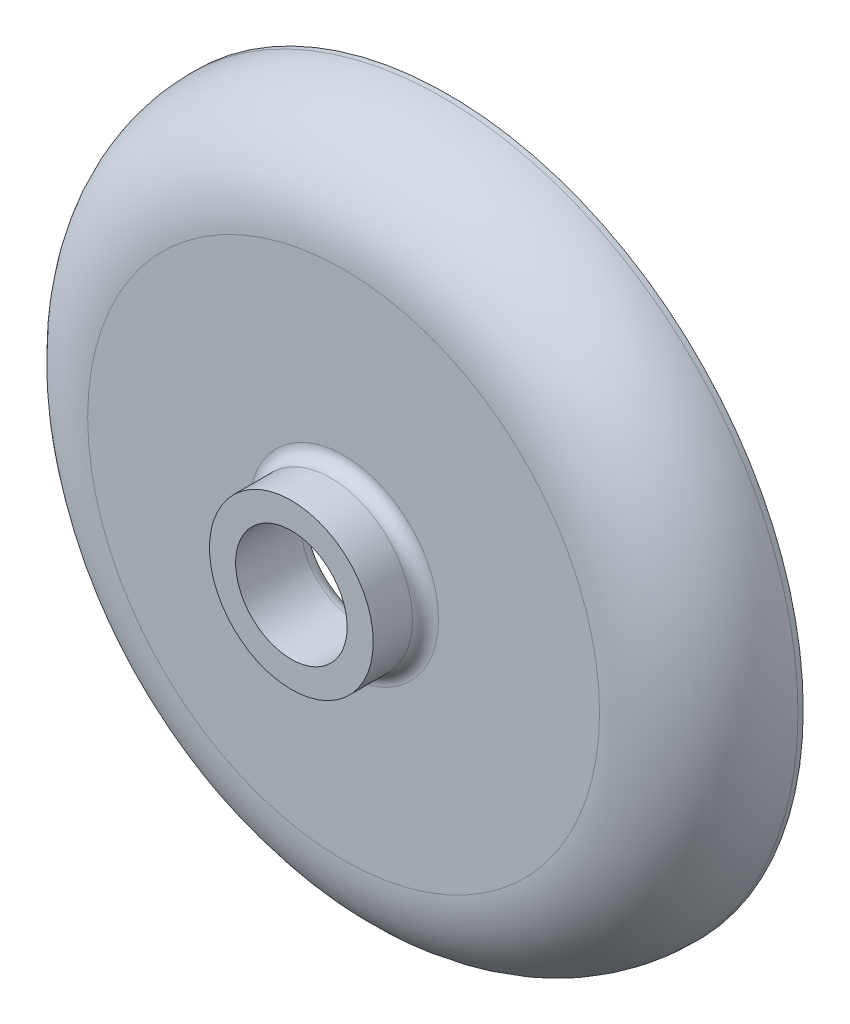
ISO-10303-21;
HEADER;
FILE_DESCRIPTION(('STEP AP214'),'2;1');
FILE_NAME('part.step','',(''),(''),'','','');
FILE_SCHEMA(('AUTOMOTIVE_DESIGN { 1 0 10303 214 1 1 1 1 }'));
ENDSEC;
DATA;
#1=APPLICATION_CONTEXT('core data for automotive mechanical design processes');
#2=APPLICATION_PROTOCOL_DEFINITION('international standard','automotive_design',2000,#1);
#3=PRODUCT_CONTEXT('',#1,'mechanical');
#4=PRODUCT('Part','Part','',(#3));
#5=PRODUCT_RELATED_PRODUCT_CATEGORY('part','',(#4));
#6=PRODUCT_DEFINITION_FORMATION('','',#4);
#7=PRODUCT_DEFINITION_CONTEXT('part definition',#1,'design');
#8=PRODUCT_DEFINITION('design','',#6,#7);
#9=PRODUCT_DEFINITION_SHAPE('','',#8);
#10=(LENGTH_UNIT() NAMED_UNIT(*) SI_UNIT(.MILLI.,.METRE.));
#11=(NAMED_UNIT(*) PLANE_ANGLE_UNIT() SI_UNIT($,.RADIAN.));
#12=(NAMED_UNIT(*) SI_UNIT($,.STERADIAN.) SOLID_ANGLE_UNIT());
#13=UNCERTAINTY_MEASURE_WITH_UNIT(LENGTH_MEASURE(1.E-05),#10,'distance_accuracy_value','');
#14=(GEOMETRIC_REPRESENTATION_CONTEXT(3) GLOBAL_UNCERTAINTY_ASSIGNED_CONTEXT((#13)) GLOBAL_UNIT_ASSIGNED_CONTEXT((#10,
#11,#12)) REPRESENTATION_CONTEXT('',''));
#15=CARTESIAN_POINT('',(0.,0.,0.));
#16=DIRECTION('',(0.,0.,1.));
#17=DIRECTION('',(1.,0.,0.));
#18=AXIS2_PLACEMENT_3D('',#15,#16,#17);
#19=CARTESIAN_POINT('',(0.,0.,4.));
#20=DIRECTION('',(0.,0.,-1.));
#21=DIRECTION('',(-1.,0.,0.));
#22=AXIS2_PLACEMENT_3D('',#19,#20,#21);
#23=CYLINDRICAL_SURFACE('',#22,13.6);
#24=CARTESIAN_POINT('',(0.,0.,0.2));
#25=DIRECTION('',(0.,0.,1.));
#26=DIRECTION('',(1.,0.,0.));
#27=AXIS2_PLACEMENT_3D('',#24,#25,#26);
#28=CIRCLE('',#27,13.6);
#29=CARTESIAN_POINT('',(13.6,0.,0.2));
#30=VERTEX_POINT('',#29);
#31=EDGE_CURVE('E55',#30,#30,#28,.F.);
#32=ORIENTED_EDGE('',*,*,#31,.T.);
#33=EDGE_LOOP('',(#32));
#34=FACE_BOUND('',#33,.T.);
#35=CARTESIAN_POINT('',(0.,0.,0.));
#36=DIRECTION('',(0.,0.,1.));
#37=DIRECTION('',(1.,0.,0.));
#38=AXIS2_PLACEMENT_3D('',#35,#36,#37);
#39=CIRCLE('',#38,13.6);
#40=CARTESIAN_POINT('',(13.6,0.,0.));
#41=VERTEX_POINT('',#40);
#42=EDGE_CURVE('E61',#41,#41,#39,.T.);
#43=ORIENTED_EDGE('',*,*,#42,.T.);
#44=EDGE_LOOP('',(#43));
#45=FACE_BOUND('',#44,.T.);
#46=ADVANCED_FACE('F35',(#34,#45),#23,.T.);
#47=CARTESIAN_POINT('',(0.,0.,4.));
#48=DIRECTION('',(0.,0.,1.));
#49=DIRECTION('',(1.,0.,0.));
#50=AXIS2_PLACEMENT_3D('',#47,#48,#49);
#51=PLANE('',#50);
#52=CARTESIAN_POINT('',(0.,0.,4.));
#53=DIRECTION('',(0.,0.,1.));
#54=DIRECTION('',(1.,0.,0.));
#55=AXIS2_PLACEMENT_3D('',#52,#53,#54);
#56=CIRCLE('',#55,3.635);
#57=CARTESIAN_POINT('',(3.635,0.,4.));
#58=VERTEX_POINT('',#57);
#59=EDGE_CURVE('E46',#58,#58,#56,.F.);
#60=ORIENTED_EDGE('',*,*,#59,.T.);
#61=EDGE_LOOP('',(#60));
#62=FACE_BOUND('',#61,.T.);
#63=CARTESIAN_POINT('',(0.,0.,4.));
#64=DIRECTION('',(0.,0.,1.));
#65=DIRECTION('',(1.,0.,0.));
#66=AXIS2_PLACEMENT_3D('',#63,#64,#65);
#67=CIRCLE('',#66,9.8);
#68=CARTESIAN_POINT('',(9.8,0.,4.));
#69=VERTEX_POINT('',#68);
#70=EDGE_CURVE('E58',#69,#69,#67,.T.);
#71=ORIENTED_EDGE('',*,*,#70,.T.);
#72=EDGE_LOOP('',(#71));
#73=FACE_BOUND('',#72,.T.);
#74=ADVANCED_FACE('F102',(#62,#73),#51,.T.);
#75=CARTESIAN_POINT('',(0.,0.,0.));
#76=DIRECTION('',(0.,0.,1.));
#77=DIRECTION('',(1.,0.,0.));
#78=AXIS2_PLACEMENT_3D('',#75,#76,#77);
#79=PLANE('',#78);
#80=CARTESIAN_POINT('',(0.,0.,0.));
#81=DIRECTION('',(0.,0.,1.));
#82=DIRECTION('',(1.,0.,0.));
#83=AXIS2_PLACEMENT_3D('',#80,#81,#82);
#84=CIRCLE('',#83,12.6);
#85=CARTESIAN_POINT('',(12.6,0.,0.));
#86=VERTEX_POINT('',#85);
#87=EDGE_CURVE('E68',#86,#86,#84,.T.);
#88=ORIENTED_EDGE('',*,*,#87,.T.);
#89=EDGE_LOOP('',(#88));
#90=FACE_BOUND('',#89,.T.);
#91=ORIENTED_EDGE('',*,*,#42,.F.);
#92=EDGE_LOOP('',(#91));
#93=FACE_BOUND('',#92,.T.);
#94=ADVANCED_FACE('F97',(#90,#93),#79,.F.);
#95=CARTESIAN_POINT('',(0.,0.,0.2));
#96=DIRECTION('',(0.,0.,1.));
#97=DIRECTION('',(1.,0.,0.));
#98=AXIS2_PLACEMENT_3D('',#95,#96,#97);
#99=TOROIDAL_SURFACE('',#98,9.8,3.8);
#100=ORIENTED_EDGE('',*,*,#31,.F.);
#101=EDGE_LOOP('',(#100));
#102=FACE_BOUND('',#101,.T.);
#103=ORIENTED_EDGE('',*,*,#70,.F.);
#104=EDGE_LOOP('',(#103));
#105=FACE_BOUND('',#104,.T.);
#106=ADVANCED_FACE('F91',(#102,#105),#99,.T.);
#107=CARTESIAN_POINT('',(0.,0.,6.));
#108=DIRECTION('',(0.,0.,-1.));
#109=DIRECTION('',(-1.,0.,0.));
#110=AXIS2_PLACEMENT_3D('',#107,#108,#109);
#111=CYLINDRICAL_SURFACE('',#110,3.135);
#112=CARTESIAN_POINT('',(0.,0.,4.5));
#113=DIRECTION('',(0.,0.,1.));
#114=DIRECTION('',(1.,0.,0.));
#115=AXIS2_PLACEMENT_3D('',#112,#113,#114);
#116=CIRCLE('',#115,3.135);
#117=CARTESIAN_POINT('',(3.135,0.,4.5));
#118=VERTEX_POINT('',#117);
#119=EDGE_CURVE('E50',#118,#118,#116,.T.);
#120=ORIENTED_EDGE('',*,*,#119,.T.);
#121=EDGE_LOOP('',(#120));
#122=FACE_BOUND('',#121,.T.);
#123=CARTESIAN_POINT('',(0.,0.,6.));
#124=DIRECTION('',(0.,0.,1.));
#125=DIRECTION('',(1.,0.,0.));
#126=AXIS2_PLACEMENT_3D('',#123,#124,#125);
#127=CIRCLE('',#126,3.135);
#128=CARTESIAN_POINT('',(3.135,0.,6.));
#129=VERTEX_POINT('',#128);
#130=EDGE_CURVE('E64',#129,#129,#127,.T.);
#131=ORIENTED_EDGE('',*,*,#130,.F.);
#132=EDGE_LOOP('',(#131));
#133=FACE_BOUND('',#132,.T.);
#134=ADVANCED_FACE('F86',(#122,#133),#111,.T.);
#135=CARTESIAN_POINT('',(0.,0.,6.));
#136=DIRECTION('',(0.,0.,1.));
#137=DIRECTION('',(1.,0.,0.));
#138=AXIS2_PLACEMENT_3D('',#135,#136,#137);
#139=PLANE('',#138);
#140=CARTESIAN_POINT('',(0.,0.,6.));
#141=DIRECTION('',(0.,0.,1.));
#142=DIRECTION('',(1.,0.,0.));
#143=AXIS2_PLACEMENT_3D('',#140,#141,#142);
#144=CIRCLE('',#143,2.135);
#145=CARTESIAN_POINT('',(2.135,0.,6.));
#146=VERTEX_POINT('',#145);
#147=EDGE_CURVE('E72',#146,#146,#144,.T.);
#148=ORIENTED_EDGE('',*,*,#147,.F.);
#149=EDGE_LOOP('',(#148));
#150=FACE_BOUND('',#149,.T.);
#151=ORIENTED_EDGE('',*,*,#130,.T.);
#152=EDGE_LOOP('',(#151));
#153=FACE_BOUND('',#152,.T.);
#154=ADVANCED_FACE('F82',(#150,#153),#139,.T.);
#155=CARTESIAN_POINT('',(0.,0.,4.));
#156=DIRECTION('',(0.,0.,-1.));
#157=DIRECTION('',(-1.,0.,0.));
#158=AXIS2_PLACEMENT_3D('',#155,#156,#157);
#159=CYLINDRICAL_SURFACE('',#158,12.6);
#160=CARTESIAN_POINT('',(0.,0.,0.2));
#161=DIRECTION('',(0.,0.,-1.));
#162=DIRECTION('',(-1.,0.,0.));
#163=AXIS2_PLACEMENT_3D('',#160,#161,#162);
#164=CIRCLE('',#163,12.6);
#165=CARTESIAN_POINT('',(-12.6,0.,0.2));
#166=VERTEX_POINT('',#165);
#167=EDGE_CURVE('E67',#166,#166,#164,.T.);
#168=ORIENTED_EDGE('',*,*,#167,.F.);
#169=EDGE_LOOP('',(#168));
#170=FACE_BOUND('',#169,.T.);
#171=ORIENTED_EDGE('',*,*,#87,.F.);
#172=EDGE_LOOP('',(#171));
#173=FACE_BOUND('',#172,.T.);
#174=ADVANCED_FACE('F85',(#170,#173),#159,.F.);
#175=CARTESIAN_POINT('',(0.,0.,3.));
#176=DIRECTION('',(0.,0.,1.));
#177=DIRECTION('',(1.,0.,0.));
#178=AXIS2_PLACEMENT_3D('',#175,#176,#177);
#179=PLANE('',#178);
#180=CARTESIAN_POINT('',(0.,0.,3.));
#181=DIRECTION('',(0.,0.,1.));
#182=DIRECTION('',(1.,0.,0.));
#183=AXIS2_PLACEMENT_3D('',#180,#181,#182);
#184=CIRCLE('',#183,2.635);
#185=CARTESIAN_POINT('',(2.635,0.,3.));
#186=VERTEX_POINT('',#185);
#187=EDGE_CURVE('E42',#186,#186,#184,.T.);
#188=ORIENTED_EDGE('',*,*,#187,.T.);
#189=EDGE_LOOP('',(#188));
#190=FACE_BOUND('',#189,.T.);
#191=CARTESIAN_POINT('',(0.,0.,3.));
#192=DIRECTION('',(0.,0.,1.));
#193=DIRECTION('',(1.,0.,0.));
#194=AXIS2_PLACEMENT_3D('',#191,#192,#193);
#195=CIRCLE('',#194,9.8);
#196=CARTESIAN_POINT('',(9.8,0.,3.));
#197=VERTEX_POINT('',#196);
#198=EDGE_CURVE('E71',#197,#197,#195,.T.);
#199=ORIENTED_EDGE('',*,*,#198,.F.);
#200=EDGE_LOOP('',(#199));
#201=FACE_BOUND('',#200,.T.);
#202=ADVANCED_FACE('F130',(#190,#201),#179,.F.);
#203=CARTESIAN_POINT('',(0.,0.,0.2));
#204=DIRECTION('',(0.,0.,1.));
#205=DIRECTION('',(1.,0.,0.));
#206=AXIS2_PLACEMENT_3D('',#203,#204,#205);
#207=TOROIDAL_SURFACE('',#206,9.8,2.8);
#208=ORIENTED_EDGE('',*,*,#167,.T.);
#209=EDGE_LOOP('',(#208));
#210=FACE_BOUND('',#209,.T.);
#211=ORIENTED_EDGE('',*,*,#198,.T.);
#212=EDGE_LOOP('',(#211));
#213=FACE_BOUND('',#212,.T.);
#214=ADVANCED_FACE('F119',(#210,#213),#207,.F.);
#215=CARTESIAN_POINT('',(0.,0.,6.));
#216=DIRECTION('',(0.,0.,-1.));
#217=DIRECTION('',(-1.,0.,0.));
#218=AXIS2_PLACEMENT_3D('',#215,#216,#217);
#219=CYLINDRICAL_SURFACE('',#218,2.135);
#220=CARTESIAN_POINT('',(0.,0.,3.5));
#221=DIRECTION('',(0.,0.,1.));
#222=DIRECTION('',(1.,0.,0.));
#223=AXIS2_PLACEMENT_3D('',#220,#221,#222);
#224=CIRCLE('',#223,2.135);
#225=CARTESIAN_POINT('',(2.135,0.,3.5));
#226=VERTEX_POINT('',#225);
#227=EDGE_CURVE('E10',#226,#226,#224,.F.);
#228=ORIENTED_EDGE('',*,*,#227,.T.);
#229=EDGE_LOOP('',(#228));
#230=FACE_BOUND('',#229,.T.);
#231=ORIENTED_EDGE('',*,*,#147,.T.);
#232=EDGE_LOOP('',(#231));
#233=FACE_BOUND('',#232,.T.);
#234=ADVANCED_FACE('F80',(#230,#233),#219,.F.);
#235=CARTESIAN_POINT('',(0.,0.,4.5));
#236=DIRECTION('',(0.,0.,1.));
#237=DIRECTION('',(1.,0.,0.));
#238=AXIS2_PLACEMENT_3D('',#235,#236,#237);
#239=TOROIDAL_SURFACE('',#238,3.635,0.5);
#240=ORIENTED_EDGE('',*,*,#59,.F.);
#241=EDGE_LOOP('',(#240));
#242=FACE_BOUND('',#241,.T.);
#243=ORIENTED_EDGE('',*,*,#119,.F.);
#244=EDGE_LOOP('',(#243));
#245=FACE_BOUND('',#244,.T.);
#246=ADVANCED_FACE('F111',(#242,#245),#239,.F.);
#247=CARTESIAN_POINT('',(0.,0.,3.5));
#248=DIRECTION('',(0.,0.,1.));
#249=DIRECTION('',(1.,0.,0.));
#250=AXIS2_PLACEMENT_3D('',#247,#248,#249);
#251=TOROIDAL_SURFACE('',#250,2.635,0.5);
#252=ORIENTED_EDGE('',*,*,#227,.F.);
#253=EDGE_LOOP('',(#252));
#254=FACE_BOUND('',#253,.T.);
#255=ORIENTED_EDGE('',*,*,#187,.F.);
#256=EDGE_LOOP('',(#255));
#257=FACE_BOUND('',#256,.T.);
#258=ADVANCED_FACE('F37',(#254,#257),#251,.T.);
#259=CLOSED_SHELL('',(#46,#74,#94,#106,#134,#154,#174,#202,#214,#234,#246,#258));
#260=MANIFOLD_SOLID_BREP('B2',#259);
#261=ADVANCED_BREP_SHAPE_REPRESENTATION('',(#18,#260),#14);
#262=SHAPE_DEFINITION_REPRESENTATION(#9,#261);
ENDSEC;
END-ISO-10303-21;
